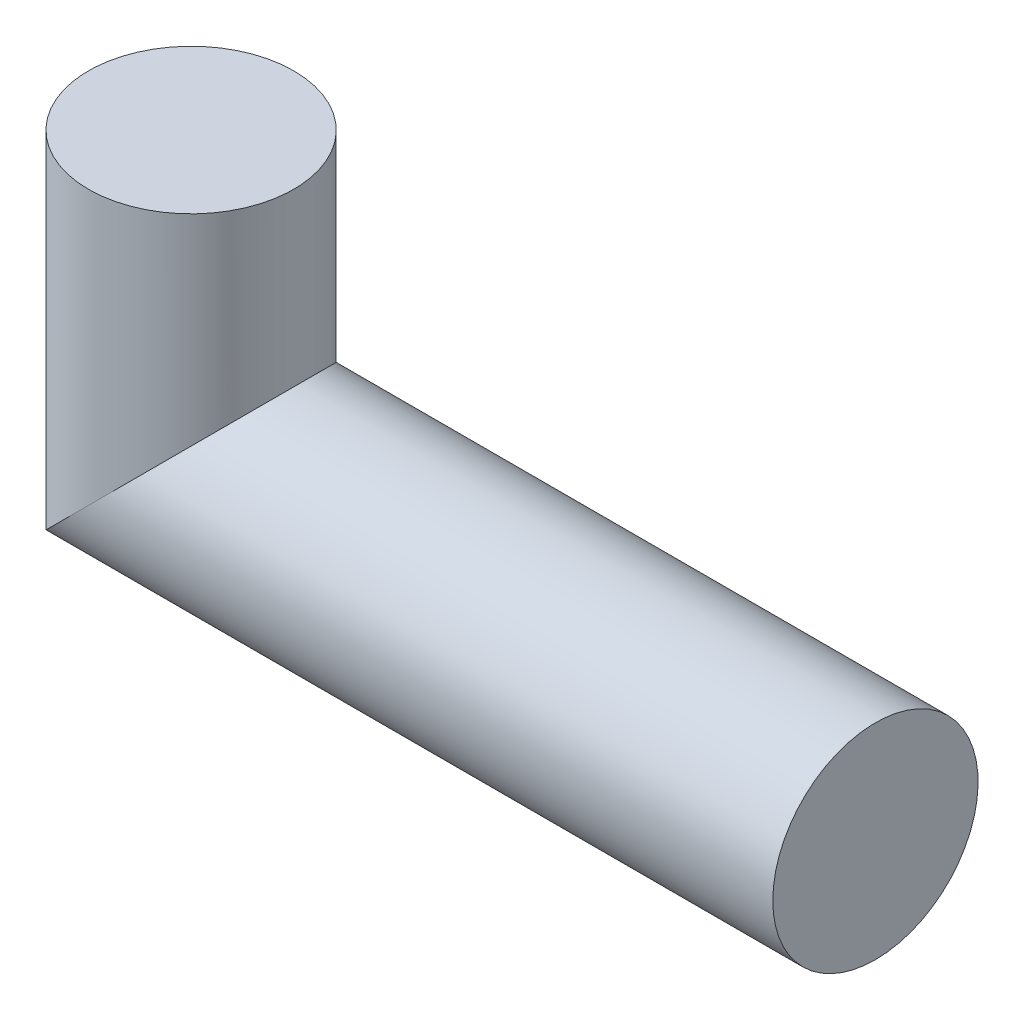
from build123d import *

# Parameters (mm, degrees)
SKETCH1_R = 19.05


with BuildPart() as part:
    # Sweep1: sweep along a path in Sketch2
    with BuildLine(Plane.XY) as sweep1_path:
        Line((0, 0), (0, -50.8))
        Line((0, -50.8), (127, -50.8))
    # Sketch1 → Sweep1 (sweep)
    with BuildSketch(Plane(origin=(0, 0, 0), x_dir=(1, 0, 0), z_dir=(0, 1, 0))):
        Circle(SKETCH1_R)
    sweep(path=sweep1_path.line, transition=Transition.RIGHT)


solid = part.part
